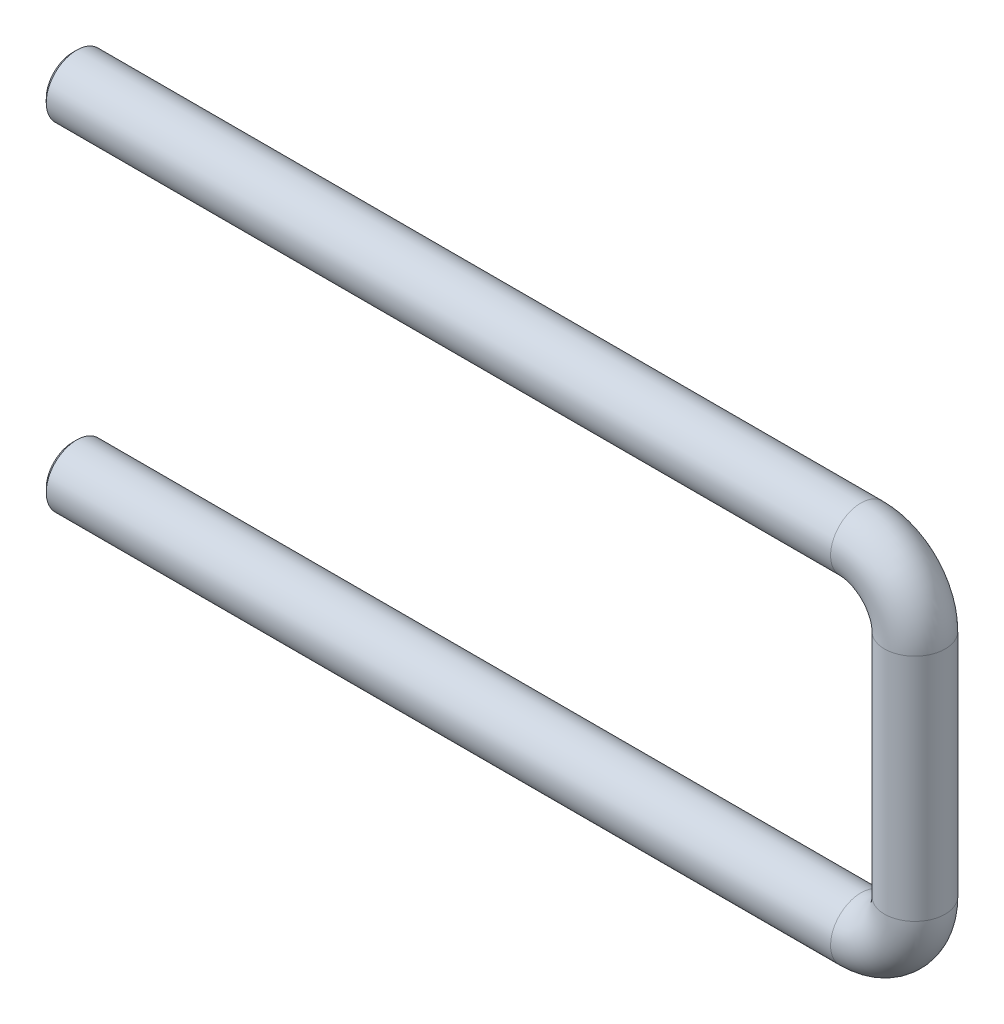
ISO-10303-21;
HEADER;
FILE_DESCRIPTION(('STEP AP214'),'2;1');
FILE_NAME('part.step','',(''),(''),'','','');
FILE_SCHEMA(('AUTOMOTIVE_DESIGN { 1 0 10303 214 1 1 1 1 }'));
ENDSEC;
DATA;
#1=APPLICATION_CONTEXT('core data for automotive mechanical design processes');
#2=APPLICATION_PROTOCOL_DEFINITION('international standard','automotive_design',2000,#1);
#3=PRODUCT_CONTEXT('',#1,'mechanical');
#4=PRODUCT('Part','Part','',(#3));
#5=PRODUCT_RELATED_PRODUCT_CATEGORY('part','',(#4));
#6=PRODUCT_DEFINITION_FORMATION('','',#4);
#7=PRODUCT_DEFINITION_CONTEXT('part definition',#1,'design');
#8=PRODUCT_DEFINITION('design','',#6,#7);
#9=PRODUCT_DEFINITION_SHAPE('','',#8);
#10=(LENGTH_UNIT() NAMED_UNIT(*) SI_UNIT(.MILLI.,.METRE.));
#11=(NAMED_UNIT(*) PLANE_ANGLE_UNIT() SI_UNIT($,.RADIAN.));
#12=(NAMED_UNIT(*) SI_UNIT($,.STERADIAN.) SOLID_ANGLE_UNIT());
#13=UNCERTAINTY_MEASURE_WITH_UNIT(LENGTH_MEASURE(1.E-05),#10,'distance_accuracy_value','');
#14=(GEOMETRIC_REPRESENTATION_CONTEXT(3) GLOBAL_UNCERTAINTY_ASSIGNED_CONTEXT((#13)) GLOBAL_UNIT_ASSIGNED_CONTEXT((#10,
#11,#12)) REPRESENTATION_CONTEXT('',''));
#15=CARTESIAN_POINT('',(0.,0.,0.));
#16=DIRECTION('',(0.,0.,1.));
#17=DIRECTION('',(1.,0.,0.));
#18=AXIS2_PLACEMENT_3D('',#15,#16,#17);
#19=CARTESIAN_POINT('',(-62.4118960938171,-6.55050000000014,-24.052000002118));
#20=DIRECTION('',(-1.,0.,0.));
#21=DIRECTION('',(0.,-1.,0.));
#22=AXIS2_PLACEMENT_3D('',#19,#20,#21);
#23=PLANE('',#22);
#24=CARTESIAN_POINT('',(-62.4118960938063,-6.55050000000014,-24.052000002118));
#25=DIRECTION('',(1.,0.,0.));
#26=DIRECTION('',(0.,1.,0.));
#27=AXIS2_PLACEMENT_3D('',#24,#25,#26);
#28=CIRCLE('',#27,3.50000000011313);
#29=CARTESIAN_POINT('',(-62.4118960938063,-3.05049999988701,-24.052000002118));
#30=VERTEX_POINT('',#29);
#31=EDGE_CURVE('E15',#30,#30,#28,.T.);
#32=ORIENTED_EDGE('',*,*,#31,.F.);
#33=EDGE_LOOP('',(#32));
#34=FACE_BOUND('',#33,.T.);
#35=ADVANCED_FACE('F12',(#34),#23,.T.);
#36=CARTESIAN_POINT('',(-61.9118960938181,-6.55050000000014,-24.052000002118));
#37=DIRECTION('',(1.,0.,0.));
#38=DIRECTION('',(0.,1.,0.));
#39=AXIS2_PLACEMENT_3D('',#36,#37,#38);
#40=CONICAL_SURFACE('',#39,3.99999999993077,0.785398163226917);
#41=ORIENTED_EDGE('',*,*,#31,.T.);
#42=EDGE_LOOP('',(#41));
#43=FACE_BOUND('',#42,.T.);
#44=CARTESIAN_POINT('',(-61.9118960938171,-6.55050000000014,-24.052000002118));
#45=DIRECTION('',(-1.,0.,0.));
#46=DIRECTION('',(0.,0.,1.));
#47=AXIS2_PLACEMENT_3D('',#44,#45,#46);
#48=CIRCLE('',#47,4.);
#49=CARTESIAN_POINT('',(-61.9118960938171,-6.55050000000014,-20.052000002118));
#50=VERTEX_POINT('',#49);
#51=EDGE_CURVE('E59',#50,#50,#48,.F.);
#52=ORIENTED_EDGE('',*,*,#51,.F.);
#53=EDGE_LOOP('',(#52));
#54=FACE_BOUND('',#53,.T.);
#55=ADVANCED_FACE('F126',(#43,#54),#40,.T.);
#56=CARTESIAN_POINT('',(41.4761039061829,-6.55050000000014,-24.052000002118));
#57=DIRECTION('',(-1.,0.,0.));
#58=DIRECTION('',(0.,0.,1.));
#59=AXIS2_PLACEMENT_3D('',#56,#57,#58);
#60=CYLINDRICAL_SURFACE('',#59,4.);
#61=CARTESIAN_POINT('',(41.4761039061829,-6.55050000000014,-24.052000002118));
#62=DIRECTION('',(-1.,0.,0.));
#63=DIRECTION('',(0.,1.,0.));
#64=AXIS2_PLACEMENT_3D('',#61,#62,#63);
#65=CIRCLE('',#64,4.);
#66=CARTESIAN_POINT('',(41.4761039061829,-2.55050000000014,-24.052000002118));
#67=VERTEX_POINT('',#66);
#68=EDGE_CURVE('E56',#67,#67,#65,.F.);
#69=ORIENTED_EDGE('',*,*,#68,.F.);
#70=EDGE_LOOP('',(#69));
#71=FACE_BOUND('',#70,.T.);
#72=ORIENTED_EDGE('',*,*,#51,.T.);
#73=EDGE_LOOP('',(#72));
#74=FACE_BOUND('',#73,.T.);
#75=ADVANCED_FACE('F51',(#71,#74),#60,.T.);
#76=CARTESIAN_POINT('',(41.4761039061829,-13.6625000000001,-24.052000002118));
#77=DIRECTION('',(0.,0.,1.));
#78=DIRECTION('',(0.,-1.,0.));
#79=AXIS2_PLACEMENT_3D('',#76,#77,#78);
#80=TOROIDAL_SURFACE('',#79,7.11199999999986,4.);
#81=ORIENTED_EDGE('',*,*,#68,.T.);
#82=EDGE_LOOP('',(#81));
#83=FACE_BOUND('',#82,.T.);
#84=CARTESIAN_POINT('',(48.5881039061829,-13.6625000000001,-24.052000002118));
#85=DIRECTION('',(0.,1.,0.));
#86=DIRECTION('',(0.,0.,1.));
#87=AXIS2_PLACEMENT_3D('',#84,#85,#86);
#88=CIRCLE('',#87,4.);
#89=CARTESIAN_POINT('',(48.5881039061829,-13.6625000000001,-20.052000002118));
#90=VERTEX_POINT('',#89);
#91=EDGE_CURVE('E55',#90,#90,#88,.F.);
#92=ORIENTED_EDGE('',*,*,#91,.F.);
#93=EDGE_LOOP('',(#92));
#94=FACE_BOUND('',#93,.T.);
#95=ADVANCED_FACE('F46',(#83,#94),#80,.T.);
#96=CARTESIAN_POINT('',(48.5881039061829,-43.9385,-24.052000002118));
#97=DIRECTION('',(0.,1.,0.));
#98=DIRECTION('',(0.,0.,1.));
#99=AXIS2_PLACEMENT_3D('',#96,#97,#98);
#100=CYLINDRICAL_SURFACE('',#99,4.);
#101=ORIENTED_EDGE('',*,*,#91,.T.);
#102=EDGE_LOOP('',(#101));
#103=FACE_BOUND('',#102,.T.);
#104=CARTESIAN_POINT('',(48.5881039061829,-43.9385,-24.052000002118));
#105=DIRECTION('',(0.,1.,0.));
#106=DIRECTION('',(1.,0.,0.));
#107=AXIS2_PLACEMENT_3D('',#104,#105,#106);
#108=CIRCLE('',#107,4.);
#109=CARTESIAN_POINT('',(52.5881039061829,-43.9385,-24.052000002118));
#110=VERTEX_POINT('',#109);
#111=EDGE_CURVE('E29',#110,#110,#108,.F.);
#112=ORIENTED_EDGE('',*,*,#111,.F.);
#113=EDGE_LOOP('',(#112));
#114=FACE_BOUND('',#113,.T.);
#115=ADVANCED_FACE('F42',(#103,#114),#100,.T.);
#116=CARTESIAN_POINT('',(-62.4118960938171,-51.0505,-24.052000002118));
#117=DIRECTION('',(1.,0.,0.));
#118=DIRECTION('',(0.,0.,-1.));
#119=AXIS2_PLACEMENT_3D('',#116,#117,#118);
#120=PLANE('',#119);
#121=CARTESIAN_POINT('',(-62.41189609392,-51.0505,-24.052000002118));
#122=DIRECTION('',(1.,0.,0.));
#123=DIRECTION('',(0.,0.,-1.));
#124=AXIS2_PLACEMENT_3D('',#121,#122,#123);
#125=CIRCLE('',#124,3.49999999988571);
#126=CARTESIAN_POINT('',(-62.41189609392,-51.0505,-27.5520000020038));
#127=VERTEX_POINT('',#126);
#128=EDGE_CURVE('E24',#127,#127,#125,.T.);
#129=ORIENTED_EDGE('',*,*,#128,.F.);
#130=EDGE_LOOP('',(#129));
#131=FACE_BOUND('',#130,.T.);
#132=ADVANCED_FACE('F37',(#131),#120,.F.);
#133=CARTESIAN_POINT('',(41.4761039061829,-43.9385,-24.052000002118));
#134=DIRECTION('',(0.,0.,1.));
#135=DIRECTION('',(0.,-1.,0.));
#136=AXIS2_PLACEMENT_3D('',#133,#134,#135);
#137=TOROIDAL_SURFACE('',#136,7.112,4.);
#138=CARTESIAN_POINT('',(41.4761039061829,-51.0505,-24.052000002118));
#139=DIRECTION('',(-1.,0.,0.));
#140=DIRECTION('',(0.,-1.,0.));
#141=AXIS2_PLACEMENT_3D('',#138,#139,#140);
#142=CIRCLE('',#141,4.);
#143=CARTESIAN_POINT('',(41.4761039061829,-55.0505,-24.052000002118));
#144=VERTEX_POINT('',#143);
#145=EDGE_CURVE('E19',#144,#144,#142,.T.);
#146=ORIENTED_EDGE('',*,*,#145,.F.);
#147=EDGE_LOOP('',(#146));
#148=FACE_BOUND('',#147,.T.);
#149=ORIENTED_EDGE('',*,*,#111,.T.);
#150=EDGE_LOOP('',(#149));
#151=FACE_BOUND('',#150,.T.);
#152=ADVANCED_FACE('F32',(#148,#151),#137,.T.);
#153=CARTESIAN_POINT('',(-61.9118960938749,-51.0505,-24.052000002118));
#154=DIRECTION('',(1.,0.,0.));
#155=DIRECTION('',(0.,0.,-1.));
#156=AXIS2_PLACEMENT_3D('',#153,#154,#155);
#157=CONICAL_SURFACE('',#156,3.99999999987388,0.785398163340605);
#158=CARTESIAN_POINT('',(-61.9118960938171,-51.0505,-24.052000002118));
#159=DIRECTION('',(-1.,0.,0.));
#160=DIRECTION('',(0.,-1.,0.));
#161=AXIS2_PLACEMENT_3D('',#158,#159,#160);
#162=CIRCLE('',#161,4.);
#163=CARTESIAN_POINT('',(-61.9118960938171,-55.0505,-24.052000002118));
#164=VERTEX_POINT('',#163);
#165=EDGE_CURVE('E8',#164,#164,#162,.F.);
#166=ORIENTED_EDGE('',*,*,#165,.F.);
#167=EDGE_LOOP('',(#166));
#168=FACE_BOUND('',#167,.T.);
#169=ORIENTED_EDGE('',*,*,#128,.T.);
#170=EDGE_LOOP('',(#169));
#171=FACE_BOUND('',#170,.T.);
#172=ADVANCED_FACE('F36',(#168,#171),#157,.T.);
#173=CARTESIAN_POINT('',(41.4761039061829,-51.0505,-24.052000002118));
#174=DIRECTION('',(-1.,0.,0.));
#175=DIRECTION('',(0.,-1.,0.));
#176=AXIS2_PLACEMENT_3D('',#173,#174,#175);
#177=CYLINDRICAL_SURFACE('',#176,4.);
#178=ORIENTED_EDGE('',*,*,#145,.T.);
#179=EDGE_LOOP('',(#178));
#180=FACE_BOUND('',#179,.T.);
#181=ORIENTED_EDGE('',*,*,#165,.T.);
#182=EDGE_LOOP('',(#181));
#183=FACE_BOUND('',#182,.T.);
#184=ADVANCED_FACE('F74',(#180,#183),#177,.T.);
#185=CLOSED_SHELL('',(#35,#55,#75,#95,#115,#132,#152,#172,#184));
#186=MANIFOLD_SOLID_BREP('B1',#185);
#187=ADVANCED_BREP_SHAPE_REPRESENTATION('',(#18,#186),#14);
#188=SHAPE_DEFINITION_REPRESENTATION(#9,#187);
ENDSEC;
END-ISO-10303-21;
